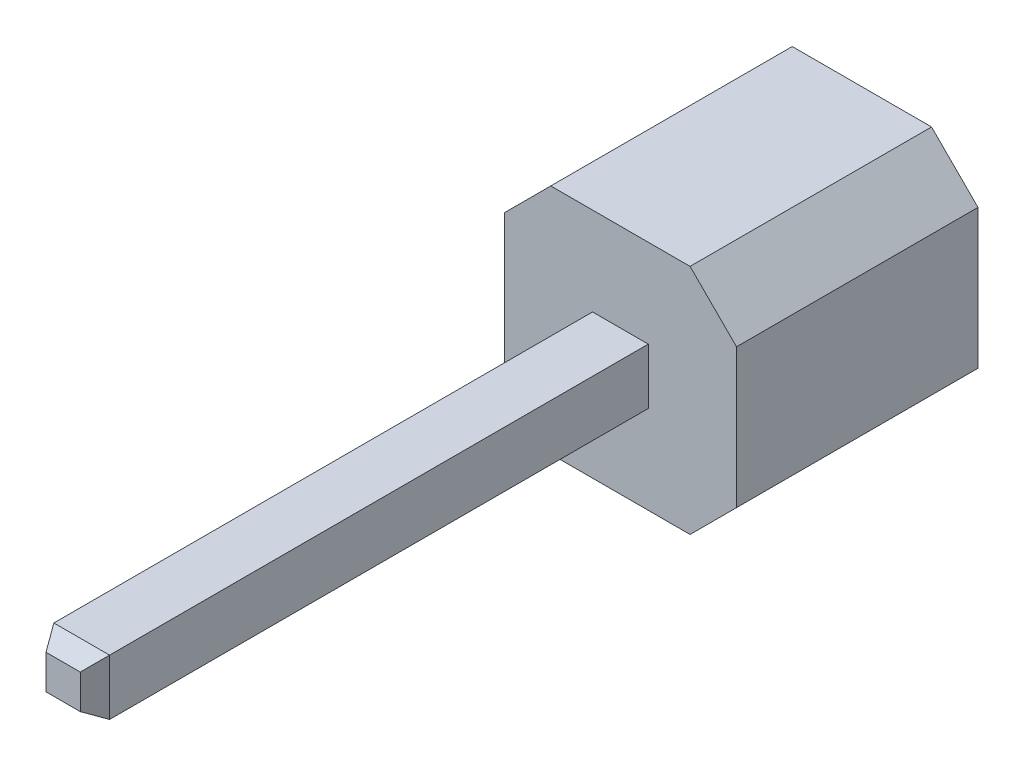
ISO-10303-21;
HEADER;
FILE_DESCRIPTION(('STEP AP214'),'2;1');
FILE_NAME('part.step','',(''),(''),'','','');
FILE_SCHEMA(('AUTOMOTIVE_DESIGN { 1 0 10303 214 1 1 1 1 }'));
ENDSEC;
DATA;
#1=APPLICATION_CONTEXT('core data for automotive mechanical design processes');
#2=APPLICATION_PROTOCOL_DEFINITION('international standard','automotive_design',2000,#1);
#3=PRODUCT_CONTEXT('',#1,'mechanical');
#4=PRODUCT('Part','Part','',(#3));
#5=PRODUCT_RELATED_PRODUCT_CATEGORY('part','',(#4));
#6=PRODUCT_DEFINITION_FORMATION('','',#4);
#7=PRODUCT_DEFINITION_CONTEXT('part definition',#1,'design');
#8=PRODUCT_DEFINITION('design','',#6,#7);
#9=PRODUCT_DEFINITION_SHAPE('','',#8);
#10=(LENGTH_UNIT() NAMED_UNIT(*) SI_UNIT(.MILLI.,.METRE.));
#11=(NAMED_UNIT(*) PLANE_ANGLE_UNIT() SI_UNIT($,.RADIAN.));
#12=(NAMED_UNIT(*) SI_UNIT($,.STERADIAN.) SOLID_ANGLE_UNIT());
#13=UNCERTAINTY_MEASURE_WITH_UNIT(LENGTH_MEASURE(1.E-05),#10,'distance_accuracy_value','');
#14=(GEOMETRIC_REPRESENTATION_CONTEXT(3) GLOBAL_UNCERTAINTY_ASSIGNED_CONTEXT((#13)) GLOBAL_UNIT_ASSIGNED_CONTEXT((#10,
#11,#12)) REPRESENTATION_CONTEXT('',''));
#15=CARTESIAN_POINT('',(0.,0.,0.));
#16=DIRECTION('',(0.,0.,1.));
#17=DIRECTION('',(1.,0.,0.));
#18=AXIS2_PLACEMENT_3D('',#15,#16,#17);
#19=CARTESIAN_POINT('',(0.,0.,2.6));
#20=DIRECTION('',(0.,0.,-1.));
#21=DIRECTION('',(-1.,0.,0.));
#22=AXIS2_PLACEMENT_3D('',#19,#20,#21);
#23=PLANE('',#22);
#24=DIRECTION('',(-1.,0.,0.));
#25=VECTOR('',#24,1.);
#26=CARTESIAN_POINT('',(-0.75,1.25,2.6));
#27=LINE('',#26,#25);
#28=CARTESIAN_POINT('',(0.75,1.25,2.6));
#29=VERTEX_POINT('',#28);
#30=CARTESIAN_POINT('',(-0.75,1.25,2.6));
#31=VERTEX_POINT('',#30);
#32=EDGE_CURVE('E161',#29,#31,#27,.T.);
#33=ORIENTED_EDGE('',*,*,#32,.T.);
#34=DIRECTION('',(-0.707106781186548,-0.707106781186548,0.));
#35=VECTOR('',#34,1.);
#36=CARTESIAN_POINT('',(-1.25,0.75,2.6));
#37=LINE('',#36,#35);
#38=CARTESIAN_POINT('',(-1.25,0.75,2.6));
#39=VERTEX_POINT('',#38);
#40=EDGE_CURVE('E164',#31,#39,#37,.T.);
#41=ORIENTED_EDGE('',*,*,#40,.T.);
#42=DIRECTION('',(0.,-1.,0.));
#43=VECTOR('',#42,1.);
#44=CARTESIAN_POINT('',(-1.25,0.75,2.6));
#45=LINE('',#44,#43);
#46=CARTESIAN_POINT('',(-1.25,-0.75,2.6));
#47=VERTEX_POINT('',#46);
#48=EDGE_CURVE('E167',#39,#47,#45,.T.);
#49=ORIENTED_EDGE('',*,*,#48,.T.);
#50=DIRECTION('',(0.707106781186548,-0.707106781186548,0.));
#51=VECTOR('',#50,1.);
#52=CARTESIAN_POINT('',(-1.25,-0.75,2.6));
#53=LINE('',#52,#51);
#54=CARTESIAN_POINT('',(-0.75,-1.25,2.6));
#55=VERTEX_POINT('',#54);
#56=EDGE_CURVE('E169',#47,#55,#53,.T.);
#57=ORIENTED_EDGE('',*,*,#56,.T.);
#58=DIRECTION('',(1.,0.,0.));
#59=VECTOR('',#58,1.);
#60=CARTESIAN_POINT('',(-0.75,-1.25,2.6));
#61=LINE('',#60,#59);
#62=CARTESIAN_POINT('',(0.75,-1.25,2.6));
#63=VERTEX_POINT('',#62);
#64=EDGE_CURVE('E171',#55,#63,#61,.T.);
#65=ORIENTED_EDGE('',*,*,#64,.T.);
#66=DIRECTION('',(0.707106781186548,0.707106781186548,0.));
#67=VECTOR('',#66,1.);
#68=CARTESIAN_POINT('',(0.75,-1.25,2.6));
#69=LINE('',#68,#67);
#70=CARTESIAN_POINT('',(1.25,-0.75,2.6));
#71=VERTEX_POINT('',#70);
#72=EDGE_CURVE('E173',#63,#71,#69,.T.);
#73=ORIENTED_EDGE('',*,*,#72,.T.);
#74=DIRECTION('',(0.,1.,0.));
#75=VECTOR('',#74,1.);
#76=CARTESIAN_POINT('',(1.25,0.75,2.6));
#77=LINE('',#76,#75);
#78=CARTESIAN_POINT('',(1.25,0.75,2.6));
#79=VERTEX_POINT('',#78);
#80=EDGE_CURVE('E175',#71,#79,#77,.T.);
#81=ORIENTED_EDGE('',*,*,#80,.T.);
#82=DIRECTION('',(-0.707106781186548,0.707106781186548,0.));
#83=VECTOR('',#82,1.);
#84=CARTESIAN_POINT('',(0.75,1.25,2.6));
#85=LINE('',#84,#83);
#86=EDGE_CURVE('E177',#79,#29,#85,.T.);
#87=ORIENTED_EDGE('',*,*,#86,.T.);
#88=EDGE_LOOP('',(#33,#41,#49,#57,#65,#73,#81,#87));
#89=FACE_BOUND('',#88,.T.);
#90=DIRECTION('',(0.,1.,0.));
#91=VECTOR('',#90,1.);
#92=CARTESIAN_POINT('',(0.3,0.3,2.6));
#93=LINE('',#92,#91);
#94=CARTESIAN_POINT('',(0.3,-0.3,2.6));
#95=VERTEX_POINT('',#94);
#96=CARTESIAN_POINT('',(0.3,0.3,2.6));
#97=VERTEX_POINT('',#96);
#98=EDGE_CURVE('E136',#95,#97,#93,.T.);
#99=ORIENTED_EDGE('',*,*,#98,.F.);
#100=DIRECTION('',(1.,0.,0.));
#101=VECTOR('',#100,1.);
#102=CARTESIAN_POINT('',(-0.3,-0.3,2.6));
#103=LINE('',#102,#101);
#104=CARTESIAN_POINT('',(-0.3,-0.3,2.6));
#105=VERTEX_POINT('',#104);
#106=EDGE_CURVE('E139',#105,#95,#103,.T.);
#107=ORIENTED_EDGE('',*,*,#106,.F.);
#108=DIRECTION('',(0.,-1.,0.));
#109=VECTOR('',#108,1.);
#110=CARTESIAN_POINT('',(-0.3,0.3,2.6));
#111=LINE('',#110,#109);
#112=CARTESIAN_POINT('',(-0.3,0.3,2.6));
#113=VERTEX_POINT('',#112);
#114=EDGE_CURVE('E150',#113,#105,#111,.T.);
#115=ORIENTED_EDGE('',*,*,#114,.F.);
#116=DIRECTION('',(-1.,0.,0.));
#117=VECTOR('',#116,1.);
#118=CARTESIAN_POINT('',(-0.3,0.3,2.6));
#119=LINE('',#118,#117);
#120=EDGE_CURVE('E147',#97,#113,#119,.T.);
#121=ORIENTED_EDGE('',*,*,#120,.F.);
#122=EDGE_LOOP('',(#99,#107,#115,#121));
#123=FACE_BOUND('',#122,.T.);
#124=ADVANCED_FACE('F34',(#89,#123),#23,.F.);
#125=CARTESIAN_POINT('',(-0.75,1.25,2.6));
#126=DIRECTION('',(0.,-1.,0.));
#127=DIRECTION('',(0.,0.,-1.));
#128=AXIS2_PLACEMENT_3D('',#125,#126,#127);
#129=PLANE('',#128);
#130=DIRECTION('',(-1.,0.,0.));
#131=VECTOR('',#130,1.);
#132=CARTESIAN_POINT('',(-0.75,1.25,0.));
#133=LINE('',#132,#131);
#134=CARTESIAN_POINT('',(0.75,1.25,0.));
#135=VERTEX_POINT('',#134);
#136=CARTESIAN_POINT('',(-0.75,1.25,0.));
#137=VERTEX_POINT('',#136);
#138=EDGE_CURVE('E160',#135,#137,#133,.T.);
#139=ORIENTED_EDGE('',*,*,#138,.T.);
#140=DIRECTION('',(0.,0.,-1.));
#141=VECTOR('',#140,1.);
#142=CARTESIAN_POINT('',(-0.75,1.25,2.6));
#143=LINE('',#142,#141);
#144=EDGE_CURVE('E215',#31,#137,#143,.T.);
#145=ORIENTED_EDGE('',*,*,#144,.F.);
#146=ORIENTED_EDGE('',*,*,#32,.F.);
#147=DIRECTION('',(0.,0.,-1.));
#148=VECTOR('',#147,1.);
#149=CARTESIAN_POINT('',(0.75,1.25,2.6));
#150=LINE('',#149,#148);
#151=EDGE_CURVE('E179',#29,#135,#150,.T.);
#152=ORIENTED_EDGE('',*,*,#151,.T.);
#153=EDGE_LOOP('',(#139,#145,#146,#152));
#154=FACE_BOUND('',#153,.T.);
#155=ADVANCED_FACE('F271',(#154),#129,.F.);
#156=CARTESIAN_POINT('',(-1.25,0.75,2.6));
#157=DIRECTION('',(0.707106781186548,-0.707106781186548,0.));
#158=DIRECTION('',(0.707106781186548,0.707106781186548,0.));
#159=AXIS2_PLACEMENT_3D('',#156,#157,#158);
#160=PLANE('',#159);
#161=DIRECTION('',(-0.707106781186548,-0.707106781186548,0.));
#162=VECTOR('',#161,1.);
#163=CARTESIAN_POINT('',(-1.25,0.75,0.));
#164=LINE('',#163,#162);
#165=CARTESIAN_POINT('',(-1.25,0.75,0.));
#166=VERTEX_POINT('',#165);
#167=EDGE_CURVE('E182',#137,#166,#164,.T.);
#168=ORIENTED_EDGE('',*,*,#167,.T.);
#169=DIRECTION('',(0.,0.,-1.));
#170=VECTOR('',#169,1.);
#171=CARTESIAN_POINT('',(-1.25,0.75,2.6));
#172=LINE('',#171,#170);
#173=EDGE_CURVE('E212',#39,#166,#172,.T.);
#174=ORIENTED_EDGE('',*,*,#173,.F.);
#175=ORIENTED_EDGE('',*,*,#40,.F.);
#176=ORIENTED_EDGE('',*,*,#144,.T.);
#177=EDGE_LOOP('',(#168,#174,#175,#176));
#178=FACE_BOUND('',#177,.T.);
#179=ADVANCED_FACE('F277',(#178),#160,.F.);
#180=CARTESIAN_POINT('',(-1.25,0.75,2.6));
#181=DIRECTION('',(1.,0.,0.));
#182=DIRECTION('',(0.,1.,0.));
#183=AXIS2_PLACEMENT_3D('',#180,#181,#182);
#184=PLANE('',#183);
#185=DIRECTION('',(0.,-1.,0.));
#186=VECTOR('',#185,1.);
#187=CARTESIAN_POINT('',(-1.25,0.75,0.));
#188=LINE('',#187,#186);
#189=CARTESIAN_POINT('',(-1.25,-0.75,0.));
#190=VERTEX_POINT('',#189);
#191=EDGE_CURVE('E184',#166,#190,#188,.T.);
#192=ORIENTED_EDGE('',*,*,#191,.T.);
#193=DIRECTION('',(0.,0.,-1.));
#194=VECTOR('',#193,1.);
#195=CARTESIAN_POINT('',(-1.25,-0.75,2.6));
#196=LINE('',#195,#194);
#197=EDGE_CURVE('E209',#47,#190,#196,.T.);
#198=ORIENTED_EDGE('',*,*,#197,.F.);
#199=ORIENTED_EDGE('',*,*,#48,.F.);
#200=ORIENTED_EDGE('',*,*,#173,.T.);
#201=EDGE_LOOP('',(#192,#198,#199,#200));
#202=FACE_BOUND('',#201,.T.);
#203=ADVANCED_FACE('F306',(#202),#184,.F.);
#204=CARTESIAN_POINT('',(-1.25,-0.75,2.6));
#205=DIRECTION('',(0.707106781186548,0.707106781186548,0.));
#206=DIRECTION('',(-0.707106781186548,0.707106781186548,0.));
#207=AXIS2_PLACEMENT_3D('',#204,#205,#206);
#208=PLANE('',#207);
#209=DIRECTION('',(0.707106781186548,-0.707106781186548,0.));
#210=VECTOR('',#209,1.);
#211=CARTESIAN_POINT('',(-1.25,-0.75,0.));
#212=LINE('',#211,#210);
#213=CARTESIAN_POINT('',(-0.75,-1.25,0.));
#214=VERTEX_POINT('',#213);
#215=EDGE_CURVE('E186',#190,#214,#212,.T.);
#216=ORIENTED_EDGE('',*,*,#215,.T.);
#217=DIRECTION('',(0.,0.,-1.));
#218=VECTOR('',#217,1.);
#219=CARTESIAN_POINT('',(-0.75,-1.25,2.6));
#220=LINE('',#219,#218);
#221=EDGE_CURVE('E206',#55,#214,#220,.T.);
#222=ORIENTED_EDGE('',*,*,#221,.F.);
#223=ORIENTED_EDGE('',*,*,#56,.F.);
#224=ORIENTED_EDGE('',*,*,#197,.T.);
#225=EDGE_LOOP('',(#216,#222,#223,#224));
#226=FACE_BOUND('',#225,.T.);
#227=ADVANCED_FACE('F302',(#226),#208,.F.);
#228=CARTESIAN_POINT('',(-0.75,-1.25,2.6));
#229=DIRECTION('',(0.,1.,0.));
#230=DIRECTION('',(0.,0.,1.));
#231=AXIS2_PLACEMENT_3D('',#228,#229,#230);
#232=PLANE('',#231);
#233=DIRECTION('',(1.,0.,0.));
#234=VECTOR('',#233,1.);
#235=CARTESIAN_POINT('',(-0.75,-1.25,0.));
#236=LINE('',#235,#234);
#237=CARTESIAN_POINT('',(0.75,-1.25,0.));
#238=VERTEX_POINT('',#237);
#239=EDGE_CURVE('E188',#214,#238,#236,.T.);
#240=ORIENTED_EDGE('',*,*,#239,.T.);
#241=DIRECTION('',(0.,0.,-1.));
#242=VECTOR('',#241,1.);
#243=CARTESIAN_POINT('',(0.75,-1.25,2.6));
#244=LINE('',#243,#242);
#245=EDGE_CURVE('E203',#63,#238,#244,.T.);
#246=ORIENTED_EDGE('',*,*,#245,.F.);
#247=ORIENTED_EDGE('',*,*,#64,.F.);
#248=ORIENTED_EDGE('',*,*,#221,.T.);
#249=EDGE_LOOP('',(#240,#246,#247,#248));
#250=FACE_BOUND('',#249,.T.);
#251=ADVANCED_FACE('F298',(#250),#232,.F.);
#252=CARTESIAN_POINT('',(0.75,-1.25,2.6));
#253=DIRECTION('',(-0.707106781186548,0.707106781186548,0.));
#254=DIRECTION('',(-0.707106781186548,-0.707106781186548,0.));
#255=AXIS2_PLACEMENT_3D('',#252,#253,#254);
#256=PLANE('',#255);
#257=DIRECTION('',(0.707106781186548,0.707106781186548,0.));
#258=VECTOR('',#257,1.);
#259=CARTESIAN_POINT('',(0.75,-1.25,0.));
#260=LINE('',#259,#258);
#261=CARTESIAN_POINT('',(1.25,-0.75,0.));
#262=VERTEX_POINT('',#261);
#263=EDGE_CURVE('E190',#238,#262,#260,.T.);
#264=ORIENTED_EDGE('',*,*,#263,.T.);
#265=DIRECTION('',(0.,0.,-1.));
#266=VECTOR('',#265,1.);
#267=CARTESIAN_POINT('',(1.25,-0.75,2.6));
#268=LINE('',#267,#266);
#269=EDGE_CURVE('E200',#71,#262,#268,.T.);
#270=ORIENTED_EDGE('',*,*,#269,.F.);
#271=ORIENTED_EDGE('',*,*,#72,.F.);
#272=ORIENTED_EDGE('',*,*,#245,.T.);
#273=EDGE_LOOP('',(#264,#270,#271,#272));
#274=FACE_BOUND('',#273,.T.);
#275=ADVANCED_FACE('F294',(#274),#256,.F.);
#276=CARTESIAN_POINT('',(1.25,0.75,2.6));
#277=DIRECTION('',(-1.,0.,0.));
#278=DIRECTION('',(0.,0.,1.));
#279=AXIS2_PLACEMENT_3D('',#276,#277,#278);
#280=PLANE('',#279);
#281=DIRECTION('',(0.,1.,0.));
#282=VECTOR('',#281,1.);
#283=CARTESIAN_POINT('',(1.25,0.75,0.));
#284=LINE('',#283,#282);
#285=CARTESIAN_POINT('',(1.25,0.75,0.));
#286=VERTEX_POINT('',#285);
#287=EDGE_CURVE('E192',#262,#286,#284,.T.);
#288=ORIENTED_EDGE('',*,*,#287,.T.);
#289=DIRECTION('',(0.,0.,-1.));
#290=VECTOR('',#289,1.);
#291=CARTESIAN_POINT('',(1.25,0.75,2.6));
#292=LINE('',#291,#290);
#293=EDGE_CURVE('E197',#79,#286,#292,.T.);
#294=ORIENTED_EDGE('',*,*,#293,.F.);
#295=ORIENTED_EDGE('',*,*,#80,.F.);
#296=ORIENTED_EDGE('',*,*,#269,.T.);
#297=EDGE_LOOP('',(#288,#294,#295,#296));
#298=FACE_BOUND('',#297,.T.);
#299=ADVANCED_FACE('F290',(#298),#280,.F.);
#300=CARTESIAN_POINT('',(0.75,1.25,2.6));
#301=DIRECTION('',(-0.707106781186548,-0.707106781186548,0.));
#302=DIRECTION('',(0.707106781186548,-0.707106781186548,0.));
#303=AXIS2_PLACEMENT_3D('',#300,#301,#302);
#304=PLANE('',#303);
#305=DIRECTION('',(-0.707106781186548,0.707106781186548,0.));
#306=VECTOR('',#305,1.);
#307=CARTESIAN_POINT('',(0.75,1.25,0.));
#308=LINE('',#307,#306);
#309=EDGE_CURVE('E165',#286,#135,#308,.T.);
#310=ORIENTED_EDGE('',*,*,#309,.T.);
#311=ORIENTED_EDGE('',*,*,#151,.F.);
#312=ORIENTED_EDGE('',*,*,#86,.F.);
#313=ORIENTED_EDGE('',*,*,#293,.T.);
#314=EDGE_LOOP('',(#310,#311,#312,#313));
#315=FACE_BOUND('',#314,.T.);
#316=ADVANCED_FACE('F286',(#315),#304,.F.);
#317=CARTESIAN_POINT('',(0.,0.,0.));
#318=DIRECTION('',(0.,0.,-1.));
#319=DIRECTION('',(-1.,0.,0.));
#320=AXIS2_PLACEMENT_3D('',#317,#318,#319);
#321=PLANE('',#320);
#322=ORIENTED_EDGE('',*,*,#138,.F.);
#323=ORIENTED_EDGE('',*,*,#309,.F.);
#324=ORIENTED_EDGE('',*,*,#287,.F.);
#325=ORIENTED_EDGE('',*,*,#263,.F.);
#326=ORIENTED_EDGE('',*,*,#239,.F.);
#327=ORIENTED_EDGE('',*,*,#215,.F.);
#328=ORIENTED_EDGE('',*,*,#191,.F.);
#329=ORIENTED_EDGE('',*,*,#167,.F.);
#330=EDGE_LOOP('',(#322,#323,#324,#325,#326,#327,#328,#329));
#331=FACE_BOUND('',#330,.T.);
#332=ADVANCED_FACE('F283',(#331),#321,.T.);
#333=CARTESIAN_POINT('',(0.3,0.3,8.6));
#334=DIRECTION('',(-1.,0.,0.));
#335=DIRECTION('',(0.,-1.,0.));
#336=AXIS2_PLACEMENT_3D('',#333,#334,#335);
#337=PLANE('',#336);
#338=DIRECTION('',(0.,0.,-1.));
#339=VECTOR('',#338,1.);
#340=CARTESIAN_POINT('',(0.3,0.3,8.6));
#341=LINE('',#340,#339);
#342=CARTESIAN_POINT('',(0.3,0.3,8.4));
#343=VERTEX_POINT('',#342);
#344=EDGE_CURVE('E158',#343,#97,#341,.T.);
#345=ORIENTED_EDGE('',*,*,#344,.F.);
#346=DIRECTION('',(0.,-1.,0.));
#347=VECTOR('',#346,1.);
#348=CARTESIAN_POINT('',(0.3,-0.3,8.4));
#349=LINE('',#348,#347);
#350=CARTESIAN_POINT('',(0.3,-0.3,8.4));
#351=VERTEX_POINT('',#350);
#352=EDGE_CURVE('E43',#343,#351,#349,.T.);
#353=ORIENTED_EDGE('',*,*,#352,.T.);
#354=DIRECTION('',(0.,0.,-1.));
#355=VECTOR('',#354,1.);
#356=CARTESIAN_POINT('',(0.3,-0.3,8.6));
#357=LINE('',#356,#355);
#358=EDGE_CURVE('E133',#351,#95,#357,.T.);
#359=ORIENTED_EDGE('',*,*,#358,.T.);
#360=ORIENTED_EDGE('',*,*,#98,.T.);
#361=EDGE_LOOP('',(#345,#353,#359,#360));
#362=FACE_BOUND('',#361,.T.);
#363=ADVANCED_FACE('F135',(#362),#337,.F.);
#364=CARTESIAN_POINT('',(-0.3,0.3,8.6));
#365=DIRECTION('',(0.,-1.,0.));
#366=DIRECTION('',(0.,0.,-1.));
#367=AXIS2_PLACEMENT_3D('',#364,#365,#366);
#368=PLANE('',#367);
#369=DIRECTION('',(0.,0.,-1.));
#370=VECTOR('',#369,1.);
#371=CARTESIAN_POINT('',(-0.3,0.3,8.6));
#372=LINE('',#371,#370);
#373=CARTESIAN_POINT('',(-0.3,0.3,8.4));
#374=VERTEX_POINT('',#373);
#375=EDGE_CURVE('E156',#374,#113,#372,.T.);
#376=ORIENTED_EDGE('',*,*,#375,.F.);
#377=DIRECTION('',(1.,0.,0.));
#378=VECTOR('',#377,1.);
#379=CARTESIAN_POINT('',(0.3,0.3,8.4));
#380=LINE('',#379,#378);
#381=EDGE_CURVE('E227',#374,#343,#380,.T.);
#382=ORIENTED_EDGE('',*,*,#381,.T.);
#383=ORIENTED_EDGE('',*,*,#344,.T.);
#384=ORIENTED_EDGE('',*,*,#120,.T.);
#385=EDGE_LOOP('',(#376,#382,#383,#384));
#386=FACE_BOUND('',#385,.T.);
#387=ADVANCED_FACE('F257',(#386),#368,.F.);
#388=CARTESIAN_POINT('',(-0.3,0.3,8.6));
#389=DIRECTION('',(1.,0.,0.));
#390=DIRECTION('',(0.,1.,0.));
#391=AXIS2_PLACEMENT_3D('',#388,#389,#390);
#392=PLANE('',#391);
#393=DIRECTION('',(0.,0.,-1.));
#394=VECTOR('',#393,1.);
#395=CARTESIAN_POINT('',(-0.3,-0.3,8.6));
#396=LINE('',#395,#394);
#397=CARTESIAN_POINT('',(-0.3,-0.3,8.4));
#398=VERTEX_POINT('',#397);
#399=EDGE_CURVE('E138',#398,#105,#396,.T.);
#400=ORIENTED_EDGE('',*,*,#399,.F.);
#401=DIRECTION('',(0.,1.,0.));
#402=VECTOR('',#401,1.);
#403=CARTESIAN_POINT('',(-0.3,0.3,8.4));
#404=LINE('',#403,#402);
#405=EDGE_CURVE('E230',#398,#374,#404,.T.);
#406=ORIENTED_EDGE('',*,*,#405,.T.);
#407=ORIENTED_EDGE('',*,*,#375,.T.);
#408=ORIENTED_EDGE('',*,*,#114,.T.);
#409=EDGE_LOOP('',(#400,#406,#407,#408));
#410=FACE_BOUND('',#409,.T.);
#411=ADVANCED_FACE('F254',(#410),#392,.F.);
#412=CARTESIAN_POINT('',(-0.3,-0.3,8.6));
#413=DIRECTION('',(0.,1.,0.));
#414=DIRECTION('',(0.,0.,1.));
#415=AXIS2_PLACEMENT_3D('',#412,#413,#414);
#416=PLANE('',#415);
#417=ORIENTED_EDGE('',*,*,#358,.F.);
#418=DIRECTION('',(-1.,0.,0.));
#419=VECTOR('',#418,1.);
#420=CARTESIAN_POINT('',(-0.3,-0.3,8.4));
#421=LINE('',#420,#419);
#422=EDGE_CURVE('E11',#351,#398,#421,.T.);
#423=ORIENTED_EDGE('',*,*,#422,.T.);
#424=ORIENTED_EDGE('',*,*,#399,.T.);
#425=ORIENTED_EDGE('',*,*,#106,.T.);
#426=EDGE_LOOP('',(#417,#423,#424,#425));
#427=FACE_BOUND('',#426,.T.);
#428=ADVANCED_FACE('F149',(#427),#416,.F.);
#429=CARTESIAN_POINT('',(0.,0.,8.6));
#430=DIRECTION('',(0.,0.,1.));
#431=DIRECTION('',(1.,0.,0.));
#432=AXIS2_PLACEMENT_3D('',#429,#430,#431);
#433=PLANE('',#432);
#434=DIRECTION('',(0.,1.,0.));
#435=VECTOR('',#434,1.);
#436=CARTESIAN_POINT('',(0.184529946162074,0.3,8.6));
#437=LINE('',#436,#435);
#438=CARTESIAN_POINT('',(0.184529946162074,-0.184529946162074,8.6));
#439=VERTEX_POINT('',#438);
#440=CARTESIAN_POINT('',(0.184529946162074,0.184529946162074,8.6));
#441=VERTEX_POINT('',#440);
#442=EDGE_CURVE('E220',#439,#441,#437,.T.);
#443=ORIENTED_EDGE('',*,*,#442,.T.);
#444=DIRECTION('',(-1.,0.,0.));
#445=VECTOR('',#444,1.);
#446=CARTESIAN_POINT('',(-0.3,0.184529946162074,8.6));
#447=LINE('',#446,#445);
#448=CARTESIAN_POINT('',(-0.184529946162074,0.184529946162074,8.6));
#449=VERTEX_POINT('',#448);
#450=EDGE_CURVE('E224',#441,#449,#447,.T.);
#451=ORIENTED_EDGE('',*,*,#450,.T.);
#452=DIRECTION('',(0.,-1.,0.));
#453=VECTOR('',#452,1.);
#454=CARTESIAN_POINT('',(-0.184529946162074,-0.3,8.6));
#455=LINE('',#454,#453);
#456=CARTESIAN_POINT('',(-0.184529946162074,-0.184529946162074,8.6));
#457=VERTEX_POINT('',#456);
#458=EDGE_CURVE('E222',#449,#457,#455,.T.);
#459=ORIENTED_EDGE('',*,*,#458,.T.);
#460=DIRECTION('',(1.,0.,0.));
#461=VECTOR('',#460,1.);
#462=CARTESIAN_POINT('',(0.3,-0.184529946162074,8.6));
#463=LINE('',#462,#461);
#464=EDGE_CURVE('E218',#457,#439,#463,.T.);
#465=ORIENTED_EDGE('',*,*,#464,.T.);
#466=EDGE_LOOP('',(#443,#451,#459,#465));
#467=FACE_BOUND('',#466,.T.);
#468=ADVANCED_FACE('F262',(#467),#433,.T.);
#469=CARTESIAN_POINT('',(0.,-0.184529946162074,8.6));
#470=DIRECTION('',(0.,-0.86602540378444,0.499999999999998));
#471=DIRECTION('',(-1.,0.,0.));
#472=AXIS2_PLACEMENT_3D('',#469,#470,#471);
#473=PLANE('',#472);
#474=DIRECTION('',(-0.447213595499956,-0.447213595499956,-0.774596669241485));
#475=VECTOR('',#474,1.);
#476=CARTESIAN_POINT('',(-0.14762395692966,-0.14762395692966,8.66392304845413));
#477=LINE('',#476,#475);
#478=EDGE_CURVE('E236',#398,#457,#477,.F.);
#479=ORIENTED_EDGE('',*,*,#478,.F.);
#480=ORIENTED_EDGE('',*,*,#422,.F.);
#481=DIRECTION('',(-0.447213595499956,0.447213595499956,0.774596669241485));
#482=VECTOR('',#481,1.);
#483=CARTESIAN_POINT('',(0.14762395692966,-0.14762395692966,8.66392304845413));
#484=LINE('',#483,#482);
#485=EDGE_CURVE('E38',#439,#351,#484,.F.);
#486=ORIENTED_EDGE('',*,*,#485,.F.);
#487=ORIENTED_EDGE('',*,*,#464,.F.);
#488=EDGE_LOOP('',(#479,#480,#486,#487));
#489=FACE_BOUND('',#488,.T.);
#490=ADVANCED_FACE('F36',(#489),#473,.T.);
#491=CARTESIAN_POINT('',(0.184529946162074,0.,8.6));
#492=DIRECTION('',(0.86602540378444,0.,0.499999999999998));
#493=DIRECTION('',(0.,-1.,0.));
#494=AXIS2_PLACEMENT_3D('',#491,#492,#493);
#495=PLANE('',#494);
#496=ORIENTED_EDGE('',*,*,#485,.T.);
#497=ORIENTED_EDGE('',*,*,#352,.F.);
#498=DIRECTION('',(-0.447213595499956,-0.447213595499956,0.774596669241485));
#499=VECTOR('',#498,1.);
#500=CARTESIAN_POINT('',(0.14762395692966,0.14762395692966,8.66392304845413));
#501=LINE('',#500,#499);
#502=EDGE_CURVE('E235',#441,#343,#501,.F.);
#503=ORIENTED_EDGE('',*,*,#502,.F.);
#504=ORIENTED_EDGE('',*,*,#442,.F.);
#505=EDGE_LOOP('',(#496,#497,#503,#504));
#506=FACE_BOUND('',#505,.T.);
#507=ADVANCED_FACE('F246',(#506),#495,.T.);
#508=CARTESIAN_POINT('',(-0.184529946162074,0.,8.6));
#509=DIRECTION('',(-0.86602540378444,0.,0.499999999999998));
#510=DIRECTION('',(0.,1.,0.));
#511=AXIS2_PLACEMENT_3D('',#508,#509,#510);
#512=PLANE('',#511);
#513=ORIENTED_EDGE('',*,*,#478,.T.);
#514=ORIENTED_EDGE('',*,*,#458,.F.);
#515=DIRECTION('',(-0.447213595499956,0.447213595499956,-0.774596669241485));
#516=VECTOR('',#515,1.);
#517=CARTESIAN_POINT('',(-0.14762395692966,0.14762395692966,8.66392304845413));
#518=LINE('',#517,#516);
#519=EDGE_CURVE('E233',#374,#449,#518,.F.);
#520=ORIENTED_EDGE('',*,*,#519,.F.);
#521=ORIENTED_EDGE('',*,*,#405,.F.);
#522=EDGE_LOOP('',(#513,#514,#520,#521));
#523=FACE_BOUND('',#522,.T.);
#524=ADVANCED_FACE('F251',(#523),#512,.T.);
#525=CARTESIAN_POINT('',(0.,0.184529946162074,8.6));
#526=DIRECTION('',(0.,0.86602540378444,0.499999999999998));
#527=DIRECTION('',(1.,0.,0.));
#528=AXIS2_PLACEMENT_3D('',#525,#526,#527);
#529=PLANE('',#528);
#530=ORIENTED_EDGE('',*,*,#502,.T.);
#531=ORIENTED_EDGE('',*,*,#381,.F.);
#532=ORIENTED_EDGE('',*,*,#519,.T.);
#533=ORIENTED_EDGE('',*,*,#450,.F.);
#534=EDGE_LOOP('',(#530,#531,#532,#533));
#535=FACE_BOUND('',#534,.T.);
#536=ADVANCED_FACE('F259',(#535),#529,.T.);
#537=CLOSED_SHELL('',(#124,#155,#179,#203,#227,#251,#275,#299,#316,#332,#363,#387,#411,#428,
#468,#490,#507,#524,#536));
#538=MANIFOLD_SOLID_BREP('B2',#537);
#539=ADVANCED_BREP_SHAPE_REPRESENTATION('',(#18,#538),#14);
#540=SHAPE_DEFINITION_REPRESENTATION(#9,#539);
ENDSEC;
END-ISO-10303-21;
